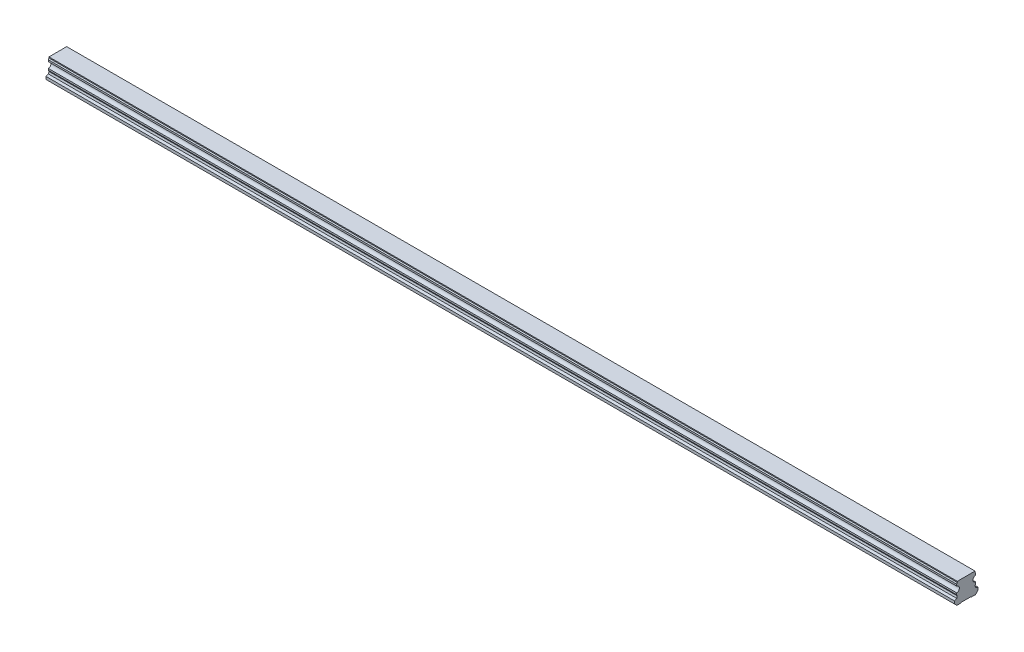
from build123d import *

# Parameters (mm, degrees)
BOSS_EXTRUDE1_DEPTH        = 960
SKETCH3_R                  = 3
SKETCH3_R_2                = 2.5
CUT_EXTRUDE3_DEPTH         = 12
SKETCH3_2_R                = 2.5
CUT_EXTRUDE4_DEPTH         = 15
CHAMFER1_SIZE              = 0.5
LPATTERN4_COUNT            = 16
LPATTERN4_PITCH            = 60
CHAMFER1_OF_LPATTERN4_SIZE = 0.5


with BuildPart() as part:
    # Sketch1 → Boss-Extrude1 (new body)
    with BuildSketch(Plane(origin=(0, 0, 0), x_dir=(0, 0, -1), z_dir=(1, 0, 0))):
        with BuildLine():
            Line((9.375, 21.8), (-9.375, 21.8))
            Line((-9.375, 21.8), (-9.375, 20.756))
            Line((-9.375, 20.756), (-10, 19.415683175))
            Line((-10, 19.415683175), (-10, 17.685449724))
            ThreePointArc((-10, 17.685449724), (-7.2, 14.6), (-10, 11.514550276))
            Line((-10, 11.514550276), (-10, 9.784316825))
            Line((-10, 9.784316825), (-9.375, 8.444))
            Line((-9.375, 8.444), (-9.922688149, 6.4))
            Line((-9.922688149, 6.4), (-12.5, 5.489338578))
            Line((-12.5, 5.489338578), (-12.5, 2.65))
            Line((-12.5, 2.65), (-9.85, 0))
            Line((-9.85, 0), (-5.5, 0))
            Line((-5.5, 0), (-5, 0.5))
            Line((-5, 0.5), (5, 0.5))
            Line((5, 0.5), (5.5, 0))
            Line((5.5, 0), (9.85, 0))
            Line((9.85, 0), (12.5, 2.65))
            Line((12.5, 2.65), (12.5, 5.489338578))
            Line((12.5, 5.489338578), (9.922688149, 6.4))
            Line((9.922688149, 6.4), (9.375, 8.444))
            Line((9.375, 8.444), (10, 9.784316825))
            Line((10, 9.784316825), (10, 11.514550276))
            ThreePointArc((10, 11.514550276), (7.2, 14.6), (10, 17.685449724))
            Line((10, 17.685449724), (10, 19.415683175))
            Line((10, 19.415683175), (9.375, 20.756))
            Line((9.375, 20.756), (9.375, 21.8))
        make_face()
    extrude(amount=BOSS_EXTRUDE1_DEPTH)

    # Sketch3 → Cut-Extrude3 (cut)
    with BuildSketch(Plane.XZ):
        with Locations(Location((30, 0, 0), (0, 0, 270))):
            Circle(SKETCH3_R)
        with Locations(Location((30, 0, 0), (0, 0, 270))):
            Circle(SKETCH3_R_2, mode=Mode.SUBTRACT)
    cut_extrude3 = extrude(amount=-CUT_EXTRUDE3_DEPTH, mode=Mode.SUBTRACT)

    # Sketch3_2 → Cut-Extrude4 (cut)
    with BuildSketch(Plane.XZ):
        with Locations(Location((30, 0, 0), (0, 0, 270))):
            Circle(SKETCH3_2_R)
    cut_extrude4 = extrude(amount=-CUT_EXTRUDE4_DEPTH, mode=Mode.SUBTRACT)

    # Cut-Extrude5 cone 1 section (on through the dimple's axis) → Cut-Extrude5 (revolve, cut)
    with BuildSketch(Plane(origin=(30, 15, 0), x_dir=(0, 0, -1), z_dir=(1, 0, 0))):
        Polygon((0, 0), (2.5, 0), (0, 1.443375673), align=None)
    cut_extrude5 = revolve(axis=Axis((30, 15, 0), (0, 1, 0)), mode=Mode.SUBTRACT)

    # Chamfer1
    chamfer1_edges = [part.edges().sort_by_distance(p)[0] for p in [
        (30, 0.5, 3),
    ]]
    chamfer(chamfer1_edges, length=CHAMFER1_SIZE)

    # LPattern4: Cut-Extrude3, Cut-Extrude4, Cut-Extrude5 ×16
    with Locations(*[(i * LPATTERN4_PITCH, 0, 0) for i in range(1, LPATTERN4_COUNT)]):
        add(cut_extrude3, mode=Mode.SUBTRACT)
        add(cut_extrude4, mode=Mode.SUBTRACT)
        add(cut_extrude5, mode=Mode.SUBTRACT)

    # Chamfer1 of LPattern4
    chamfer1_of_lpattern4_edges = [part.edges().sort_by_distance(p)[0] for p in [
        (90, 0.5, 3),
        (150, 0.5, 3),
        (210, 0.5, 3),
        (270, 0.5, 3),
        (330, 0.5, 3),
        (390, 0.5, 3),
        (450, 0.5, 3),
        (510, 0.5, 3),
        (570, 0.5, 3),
        (630, 0.5, 3),
        (690, 0.5, 3),
        (750, 0.5, 3),
        (810, 0.5, 3),
        (870, 0.5, 3),
        (930, 0.5, 3),
    ]]
    chamfer(chamfer1_of_lpattern4_edges, length=CHAMFER1_OF_LPATTERN4_SIZE)


solid = part.part
